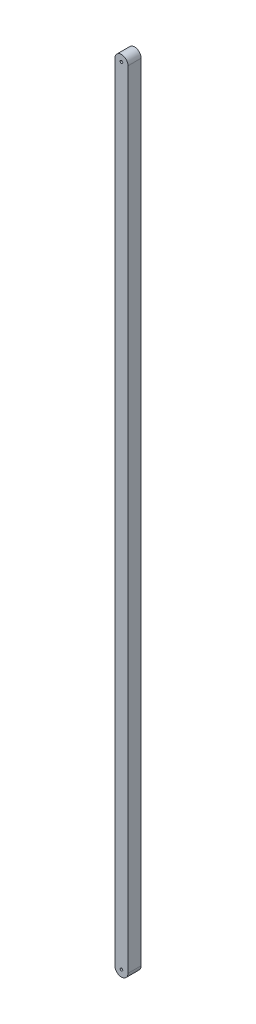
from build123d import *

# Parameters (mm, degrees)
SKETCH3_R      = 0.1
EXTRUDE1_DEPTH = 0.5


with BuildPart() as part:
    # Sketch3 → Extrude1 (new, symmetric)
    with BuildSketch(Plane.XY):
        with BuildLine():
            Line((-0.5, 30), (-0.5, -30))
            ThreePointArc((-0.5, -30), (0, -30.5), (0.5, -30))
            Line((0.5, -30), (0.5, 30))
            ThreePointArc((0.5, 30), (0, 30.5), (-0.5, 30))
        make_face()
        with Locations((0, 30)):
            Circle(SKETCH3_R, mode=Mode.SUBTRACT)
        with Locations((0, -30)):
            Circle(SKETCH3_R, mode=Mode.SUBTRACT)
    extrude(amount=EXTRUDE1_DEPTH, both=True)


solid = part.part
